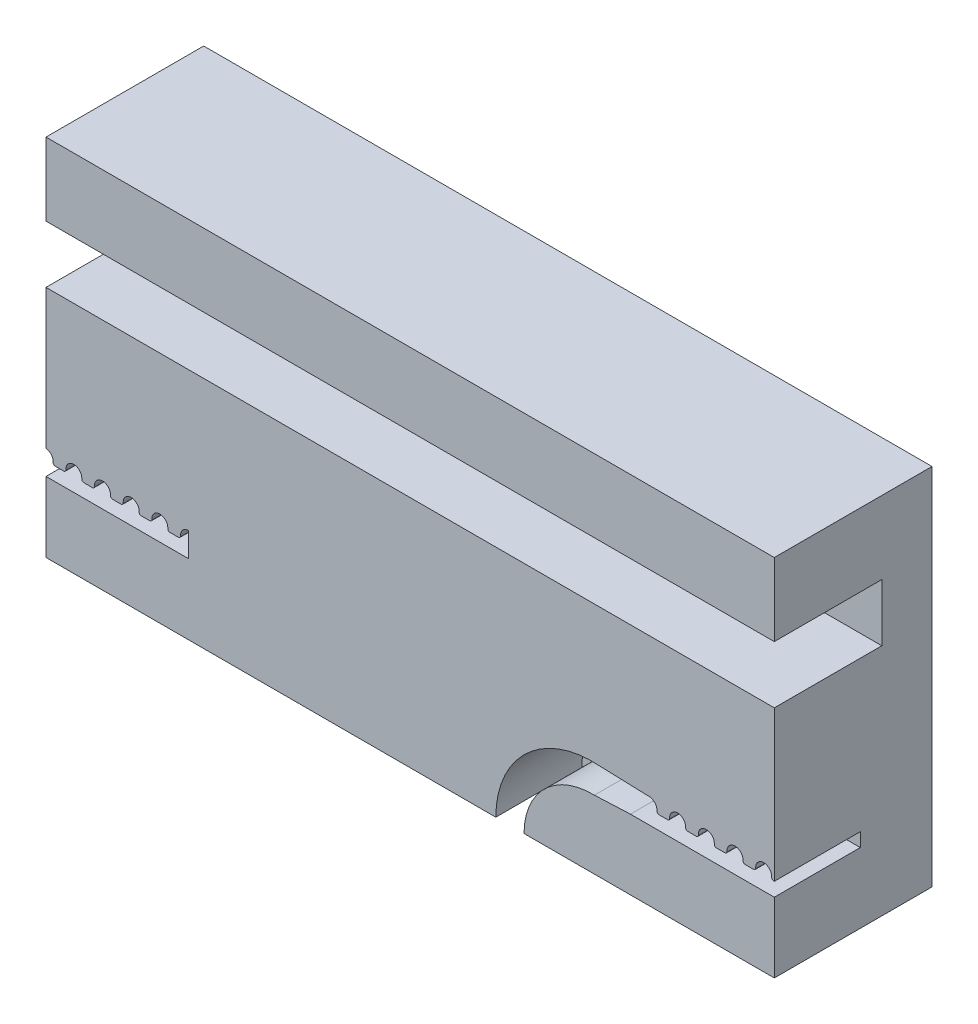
from build123d import *

# Parameters (mm, degrees)
SKETCH1_W           = 50.8
SKETCH1_H           = 25.4
BOSS_EXTRUDE1_DEPTH = 12.46
SKETCH4_W           = 38.1
SKETCH4_H           = 25.4
BOSS_EXTRUDE2_DEPTH = 44.45
SKETCH5_W           = 26.67
SKETCH5_H           = 26.67
CUT_EXTRUDE1_DEPTH  = 19.05
SKETCH7_R           = 3.429
CUT_EXTRUDE2_DEPTH  = 66.16755788
SKETCH10_W          = 7.5
SKETCH10_H          = 4
CUT_EXTRUDE3_DEPTH  = 78.334844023
CUT_EXTRUDE4_DEPTH  = 6
SKETCH11_W          = 50.8
SKETCH11_H          = 25.4
BOSS_EXTRUDE3_DEPTH = 2.54
SKETCH12_R          = 2.54
CUT_EXTRUDE5_DEPTH  = 7.62
SKETCH13_W          = 44.45
SKETCH13_H          = 25.4
CUT_EXTRUDE6_DEPTH  = 74.320124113
SKETCH15_W          = 6
SKETCH15_H          = 0.960001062
CUT_EXTRUDE8_DEPTH  = 10
SKETCH14_W          = 50.8
SKETCH14_H          = 25.4
CUT_EXTRUDE7_DEPTH  = 4


with BuildPart() as part:
    # Sketch1 → Boss-Extrude1 (new body)
    with BuildSketch(Plane.XY):
        Rectangle(SKETCH1_W, SKETCH1_H)
    extrude(amount=BOSS_EXTRUDE1_DEPTH)

    # Sketch4 → Boss-Extrude2 (add)
    with BuildSketch(Plane.XY.offset(12.46)):
        Rectangle(SKETCH4_W, SKETCH4_H)
    extrude(amount=BOSS_EXTRUDE2_DEPTH)

    # Sketch5 → Cut-Extrude1 (cut)
    with BuildSketch(Plane(origin=(0, 12.7, 0), x_dir=(1, 0, 0), z_dir=(0, 1, 0))):
        with Locations((0, -31.51)):
            Rectangle(SKETCH5_W, SKETCH5_H)
    extrude(amount=-CUT_EXTRUDE1_DEPTH, mode=Mode.SUBTRACT)

    # Sketch7 → Cut-Extrude2 (cut, through all)
    with BuildSketch(Plane(origin=(0, -6.35, 0), x_dir=(1, 0, 0), z_dir=(0, 1, 0))):
        with Locations(Location((0, -31.51, 0), (0, 0, 270))):
            Circle(SKETCH7_R)
    extrude(amount=-CUT_EXTRUDE2_DEPTH, mode=Mode.SUBTRACT)

    # Sketch10 → Cut-Extrude3 (cut, through all)
    with BuildSketch(Plane(origin=(25.4, 0, 0), x_dir=(0, 0, -1), z_dir=(1, 0, 0))):
        with Locations((-8.71, 5.62)):
            Rectangle(SKETCH10_W, SKETCH10_H)
    extrude(amount=-CUT_EXTRUDE3_DEPTH, mode=Mode.SUBTRACT)

    # Sketch3 → Cut-Extrude4 (cut)
    with BuildSketch(Plane.XY.offset(12.46)):
        with BuildLine():
            Line((-23.465217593, -6.100002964), (-23.459057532, -6.100002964))
            ThreePointArc((-23.459057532, -6.100002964), (-23.066643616, -6.262529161), (-22.904059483, -6.654919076))
            ThreePointArc((-22.904059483, -6.654919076), (-22.904499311, -6.67711383), (-22.905750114, -6.698298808))
            ThreePointArc((-22.905750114, -6.698298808), (-22.866332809, -6.811845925), (-22.75620684, -6.860001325))
            Line((-22.75620684, -6.860001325), (-22.164999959, -6.86000102))
            ThreePointArc((-22.164999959, -6.86000102), (-22.058933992, -6.81606701), (-22.015000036, -6.71000102))
            Line((-22.015000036, -6.71000102), (-22.015000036, -6.622637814))
            Line((-22.015000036, -6.622637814), (-22.013115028, -6.622637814))
            ThreePointArc((-22.013115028, -6.622637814), (-21.842134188, -6.253375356), (-21.465217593, -6.100002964))
            Line((-21.465217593, -6.100002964), (-21.459057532, -6.100002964))
            ThreePointArc((-21.459057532, -6.100002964), (-21.066642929, -6.262529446), (-20.904058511, -6.654920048))
            ThreePointArc((-20.904058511, -6.654920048), (-20.90449834, -6.67711484), (-20.905749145, -6.698299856))
            ThreePointArc((-20.905749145, -6.698299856), (-20.86633184, -6.811846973), (-20.75620587, -6.860002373))
            Line((-20.75620587, -6.860002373), (-20.16499899, -6.860002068))
            ThreePointArc((-20.16499899, -6.860002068), (-20.058933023, -6.816068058), (-20.014999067, -6.710002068))
            Line((-20.014999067, -6.710002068), (-20.014999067, -6.622634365))
            Line((-20.014999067, -6.622634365), (-20.013115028, -6.622634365))
            ThreePointArc((-20.013115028, -6.622634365), (-19.84221677, -6.253450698), (-19.465445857, -6.100002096))
            Line((-19.465445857, -6.100002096), (-19.459135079, -6.100002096))
            ThreePointArc((-19.459135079, -6.100002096), (-19.066692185, -6.262557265), (-18.904137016, -6.655000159))
            ThreePointArc((-18.904137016, -6.655000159), (-18.904579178, -6.677171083), (-18.905830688, -6.698336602))
            ThreePointArc((-18.905830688, -6.698336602), (-18.866421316, -6.811886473), (-18.75629871, -6.860049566))
            Line((-18.75629871, -6.860049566), (-18.165091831, -6.860090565))
            ThreePointArc((-18.165091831, -6.860090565), (-18.059022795, -6.816163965), (-18.015081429, -6.710101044))
            Line((-18.015081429, -6.710101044), (-18.015075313, -6.622558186))
            Line((-18.015075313, -6.622558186), (-18.013188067, -6.622558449))
            ThreePointArc((-18.013188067, -6.622558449), (-17.842155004, -6.253321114), (-17.465217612, -6.100002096))
            Line((-17.465217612, -6.100002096), (-17.459058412, -6.100002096))
            ThreePointArc((-17.459058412, -6.100002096), (-17.0666432, -6.262528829), (-16.90405853, -6.654920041))
            ThreePointArc((-16.90405853, -6.654920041), (-16.904479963, -6.67662649), (-16.905750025, -6.698299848))
            ThreePointArc((-16.905750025, -6.698299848), (-16.86633272, -6.811846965), (-16.75620675, -6.860002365))
            Line((-16.75620675, -6.860002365), (-16.164999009, -6.86000206))
            ThreePointArc((-16.164999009, -6.86000206), (-16.058933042, -6.81606805), (-16.014999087, -6.71000206))
            Line((-16.014999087, -6.71000206), (-16.014999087, -6.62264054))
            Line((-16.014999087, -6.62264054), (-16.013113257, -6.62264054))
            ThreePointArc((-16.013113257, -6.62264054), (-15.842132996, -6.253377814), (-15.465215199, -6.100356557))
            Line((-15.465215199, -6.100356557), (-15.465215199, -7.800353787))
            Line((-15.465215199, -7.800353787), (-25.439272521, -7.800353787))
            Line((-25.439272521, -7.800353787), (-25.439272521, -6.100353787))
            ThreePointArc((-25.439272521, -6.100353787), (-25.059708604, -6.269585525), (-24.904058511, -6.654918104))
            ThreePointArc((-24.904058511, -6.654918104), (-24.90449834, -6.677112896), (-24.905749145, -6.698297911))
            ThreePointArc((-24.905749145, -6.698297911), (-24.86633184, -6.811845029), (-24.75620587, -6.860000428))
            Line((-24.75620587, -6.860000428), (-24.16499899, -6.860000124))
            ThreePointArc((-24.16499899, -6.860000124), (-24.058933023, -6.816066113), (-24.014999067, -6.710000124))
            Line((-24.014999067, -6.710000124), (-24.014999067, -6.622637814))
            Line((-24.014999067, -6.622637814), (-24.013115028, -6.622637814))
            ThreePointArc((-24.013115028, -6.622637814), (-23.842134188, -6.253375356), (-23.465217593, -6.100002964))
        make_face()
        with BuildLine():
            Line((18.659057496, -6.1), (18.665217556, -6.1))
            ThreePointArc((18.665217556, -6.1), (19.042134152, -6.253372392), (19.213114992, -6.62263485))
            Line((19.213114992, -6.62263485), (19.215, -6.62263485))
            Line((19.215, -6.62263485), (19.215, -6.71))
            ThreePointArc((19.215, -6.71), (19.258934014, -6.816066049), (19.36500009, -6.86000113))
            Line((19.36500009, -6.86000113), (19.95620697, -6.860001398))
            ThreePointArc((19.95620697, -6.860001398), (20.066333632, -6.811845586), (20.105750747, -6.698297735))
            ThreePointArc((20.105750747, -6.698297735), (20.104480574, -6.676624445), (20.104059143, -6.654918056))
            ThreePointArc((20.104059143, -6.654918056), (20.266642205, -6.262526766), (20.659057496, -6.1))
            Line((20.659057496, -6.1), (20.665218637, -6.1))
            ThreePointArc((20.665218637, -6.1), (21.042151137, -6.253364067), (21.213140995, -6.622635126))
            Line((21.213140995, -6.622635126), (21.215026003, -6.622635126))
            Line((21.215026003, -6.622635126), (21.215026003, -6.710000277))
            ThreePointArc((21.215026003, -6.710000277), (21.258959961, -6.81606627), (21.365025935, -6.860002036))
            Line((21.365025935, -6.860002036), (21.956207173, -6.860002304))
            ThreePointArc((21.956207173, -6.860002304), (22.066334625, -6.81184625), (22.105749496, -6.698297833))
            ThreePointArc((22.105749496, -6.698297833), (22.104480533, -6.67666545), (22.104057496, -6.655))
            ThreePointArc((22.104057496, -6.655), (22.266613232, -6.262555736), (22.659057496, -6.1))
            Line((22.659057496, -6.1), (22.665193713, -6.1))
            ThreePointArc((22.665193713, -6.1), (23.042126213, -6.253364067), (23.213116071, -6.622635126))
            Line((23.213116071, -6.622635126), (23.215001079, -6.622635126))
            Line((23.215001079, -6.622635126), (23.215001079, -6.710000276))
            ThreePointArc((23.215001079, -6.710000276), (23.258935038, -6.816066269), (23.365001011, -6.860002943))
            Line((23.365001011, -6.860002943), (23.956207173, -6.86000321))
            ThreePointArc((23.956207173, -6.86000321), (24.066335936, -6.811846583), (24.10575146, -6.6982968))
            ThreePointArc((24.10575146, -6.6982968), (24.104483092, -6.67666447), (24.104060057, -6.65499912))
            ThreePointArc((24.104060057, -6.65499912), (24.266613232, -6.262554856), (24.659057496, -6.09999912))
            Line((24.659057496, -6.09999912), (24.665217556, -6.09999912))
            ThreePointArc((24.665217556, -6.09999912), (25.042134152, -6.253371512), (25.213114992, -6.62263397))
            Line((25.213114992, -6.62263397), (25.215000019, -6.62263397))
            Line((25.215000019, -6.62263397), (25.215000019, -6.70999912))
            ThreePointArc((25.215000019, -6.70999912), (25.258934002, -6.816065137), (25.365000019, -6.85999912))
            Line((25.365000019, -6.85999912), (25.365000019, -7.820000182))
            Line((25.365000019, -7.820000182), (15.365027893, -7.820000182))
            Line((15.365027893, -7.820000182), (12.850451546, -7.931024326))
            ThreePointArc((12.850451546, -7.931024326), (9.389006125, -9.278525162), (7.943023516, -12.700001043))
            Line((7.943023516, -12.700001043), (5.975229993, -12.700001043))
            ThreePointArc((5.975229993, -12.700001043), (8.144632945, -7.747052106), (13.256046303, -5.983117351))
            Line((13.256046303, -5.983117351), (16.679806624, -6.10035381))
            ThreePointArc((16.679806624, -6.10035381), (17.04738086, -6.258443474), (17.213114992, -6.62263485))
            Line((17.213114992, -6.62263485), (17.215, -6.62263485))
            Line((17.215, -6.62263485), (17.215, -6.71))
            ThreePointArc((17.215, -6.71), (17.258933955, -6.81606599), (17.364999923, -6.859998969))
            Line((17.364999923, -6.859998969), (17.956206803, -6.859999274))
            ThreePointArc((17.956206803, -6.859999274), (18.066332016, -6.811844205), (18.105749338, -6.698297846))
            ThreePointArc((18.105749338, -6.698297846), (18.104479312, -6.676624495), (18.10405788, -6.654918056))
            ThreePointArc((18.10405788, -6.654918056), (18.266642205, -6.262526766), (18.659057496, -6.1))
        make_face()
    extrude(amount=-CUT_EXTRUDE4_DEPTH, mode=Mode.SUBTRACT)

    # Sketch11 → Boss-Extrude3 (add)
    with BuildSketch(Plane(origin=(0, 0, 0), x_dir=(-1, 0, 0), z_dir=(0, 0, -1))):
        Rectangle(SKETCH11_W, SKETCH11_H)
    extrude(amount=BOSS_EXTRUDE3_DEPTH)

    # Sketch12 → Cut-Extrude5 (cut)
    with BuildSketch(Plane.XY.offset(56.91)):
        Circle(SKETCH12_R)
    extrude(amount=-CUT_EXTRUDE5_DEPTH, mode=Mode.SUBTRACT)

    # Sketch13 → Cut-Extrude6 (cut, through all)
    with BuildSketch(Plane.ZY.offset(19.05)):
        with Locations((34.685, 0)):
            Rectangle(SKETCH13_W, SKETCH13_H)
    extrude(amount=-CUT_EXTRUDE6_DEPTH, mode=Mode.SUBTRACT)

    # Sketch15 → Cut-Extrude8 (cut)
    with BuildSketch(Plane.ZY.offset(-25.365000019)):
        with Locations((9.46, -7.339999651)):
            Rectangle(SKETCH15_W, SKETCH15_H)
    extrude(amount=-CUT_EXTRUDE8_DEPTH, mode=Mode.SUBTRACT)

    # Sketch14 → Cut-Extrude7 (cut)
    with BuildSketch(Plane(origin=(0, 0, -2.54), x_dir=(-1, 0, 0), z_dir=(0, 0, -1))):
        Rectangle(SKETCH14_W, SKETCH14_H)
    extrude(amount=-CUT_EXTRUDE7_DEPTH, mode=Mode.SUBTRACT)


solid = part.part
